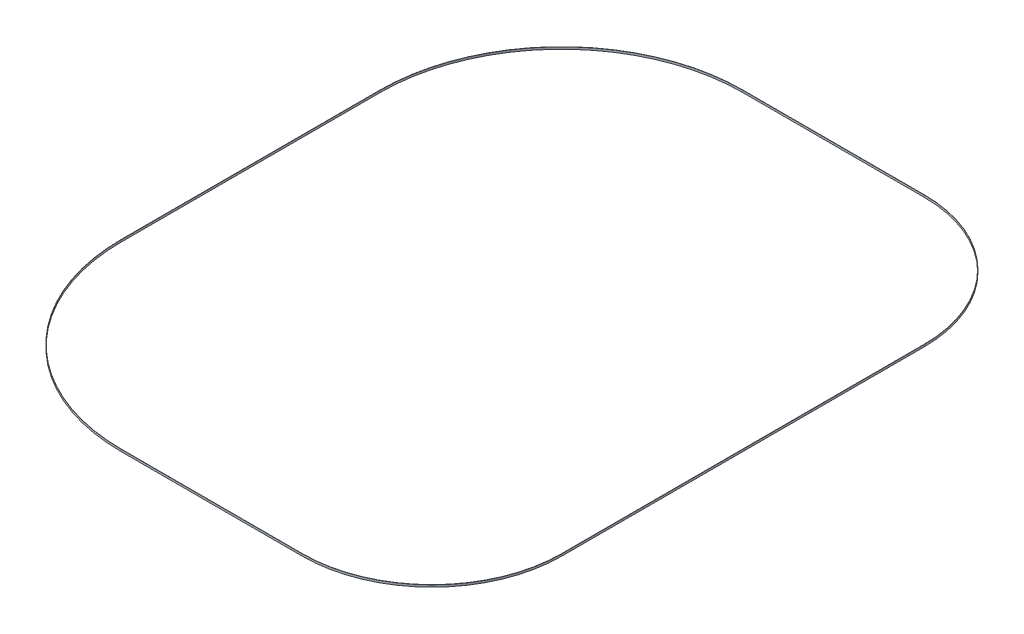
ISO-10303-21;
HEADER;
FILE_DESCRIPTION(('STEP AP214'),'2;1');
FILE_NAME('part.step','',(''),(''),'','','');
FILE_SCHEMA(('AUTOMOTIVE_DESIGN { 1 0 10303 214 1 1 1 1 }'));
ENDSEC;
DATA;
#1=APPLICATION_CONTEXT('core data for automotive mechanical design processes');
#2=APPLICATION_PROTOCOL_DEFINITION('international standard','automotive_design',2000,#1);
#3=PRODUCT_CONTEXT('',#1,'mechanical');
#4=PRODUCT('Part','Part','',(#3));
#5=PRODUCT_RELATED_PRODUCT_CATEGORY('part','',(#4));
#6=PRODUCT_DEFINITION_FORMATION('','',#4);
#7=PRODUCT_DEFINITION_CONTEXT('part definition',#1,'design');
#8=PRODUCT_DEFINITION('design','',#6,#7);
#9=PRODUCT_DEFINITION_SHAPE('','',#8);
#10=(LENGTH_UNIT() NAMED_UNIT(*) SI_UNIT(.MILLI.,.METRE.));
#11=(NAMED_UNIT(*) PLANE_ANGLE_UNIT() SI_UNIT($,.RADIAN.));
#12=(NAMED_UNIT(*) SI_UNIT($,.STERADIAN.) SOLID_ANGLE_UNIT());
#13=UNCERTAINTY_MEASURE_WITH_UNIT(LENGTH_MEASURE(1.E-05),#10,'distance_accuracy_value','');
#14=(GEOMETRIC_REPRESENTATION_CONTEXT(3) GLOBAL_UNCERTAINTY_ASSIGNED_CONTEXT((#13)) GLOBAL_UNIT_ASSIGNED_CONTEXT((#10,
#11,#12)) REPRESENTATION_CONTEXT('',''));
#15=CARTESIAN_POINT('',(0.,0.,0.));
#16=DIRECTION('',(0.,0.,1.));
#17=DIRECTION('',(1.,0.,0.));
#18=AXIS2_PLACEMENT_3D('',#15,#16,#17);
#19=CARTESIAN_POINT('',(3000.,305.,-7000.));
#20=DIRECTION('',(0.,-1.,0.));
#21=DIRECTION('',(0.,0.,-1.));
#22=AXIS2_PLACEMENT_3D('',#19,#20,#21);
#23=PLANE('',#22);
#24=CARTESIAN_POINT('',(3000.,305.,-7000.));
#25=DIRECTION('',(0.,-1.,0.));
#26=DIRECTION('',(-1.,0.,0.));
#27=AXIS2_PLACEMENT_3D('',#24,#25,#26);
#28=CIRCLE('',#27,7010.);
#29=CARTESIAN_POINT('',(3000.,305.,-14010.));
#30=VERTEX_POINT('',#29);
#31=CARTESIAN_POINT('',(-4010.,305.,-7000.));
#32=VERTEX_POINT('',#31);
#33=EDGE_CURVE('E261',#30,#32,#28,.F.);
#34=ORIENTED_EDGE('',*,*,#33,.T.);
#35=DIRECTION('',(0.,0.,1.));
#36=VECTOR('',#35,1.);
#37=CARTESIAN_POINT('',(-4010.,305.,-7000.));
#38=LINE('',#37,#36);
#39=CARTESIAN_POINT('',(-4010.,305.,3000.));
#40=VERTEX_POINT('',#39);
#41=EDGE_CURVE('E264',#32,#40,#38,.T.);
#42=ORIENTED_EDGE('',*,*,#41,.T.);
#43=CARTESIAN_POINT('',(3000.,305.,3000.));
#44=DIRECTION('',(0.,-1.,0.));
#45=DIRECTION('',(-1.,0.,0.));
#46=AXIS2_PLACEMENT_3D('',#43,#44,#45);
#47=CIRCLE('',#46,7010.);
#48=CARTESIAN_POINT('',(3000.,305.,10010.));
#49=VERTEX_POINT('',#48);
#50=EDGE_CURVE('E267',#40,#49,#47,.F.);
#51=ORIENTED_EDGE('',*,*,#50,.T.);
#52=DIRECTION('',(1.,0.,0.));
#53=VECTOR('',#52,1.);
#54=CARTESIAN_POINT('',(3000.,305.,10010.));
#55=LINE('',#54,#53);
#56=CARTESIAN_POINT('',(10000.,305.,10010.));
#57=VERTEX_POINT('',#56);
#58=EDGE_CURVE('E269',#49,#57,#55,.T.);
#59=ORIENTED_EDGE('',*,*,#58,.T.);
#60=CARTESIAN_POINT('',(10000.,305.,5000.));
#61=DIRECTION('',(0.,-1.,0.));
#62=DIRECTION('',(-1.,0.,0.));
#63=AXIS2_PLACEMENT_3D('',#60,#61,#62);
#64=CIRCLE('',#63,5010.);
#65=CARTESIAN_POINT('',(15010.,305.,5000.));
#66=VERTEX_POINT('',#65);
#67=EDGE_CURVE('E271',#57,#66,#64,.F.);
#68=ORIENTED_EDGE('',*,*,#67,.T.);
#69=DIRECTION('',(0.,0.,-1.));
#70=VECTOR('',#69,1.);
#71=CARTESIAN_POINT('',(15010.,305.,-7000.));
#72=LINE('',#71,#70);
#73=CARTESIAN_POINT('',(15010.,305.,-9000.));
#74=VERTEX_POINT('',#73);
#75=EDGE_CURVE('E273',#66,#74,#72,.T.);
#76=ORIENTED_EDGE('',*,*,#75,.T.);
#77=CARTESIAN_POINT('',(10000.,305.,-9000.));
#78=DIRECTION('',(0.,-1.,0.));
#79=DIRECTION('',(-1.,0.,0.));
#80=AXIS2_PLACEMENT_3D('',#77,#78,#79);
#81=CIRCLE('',#80,5010.);
#82=CARTESIAN_POINT('',(10000.,305.,-14010.));
#83=VERTEX_POINT('',#82);
#84=EDGE_CURVE('E275',#74,#83,#81,.F.);
#85=ORIENTED_EDGE('',*,*,#84,.T.);
#86=DIRECTION('',(-1.,0.,0.));
#87=VECTOR('',#86,1.);
#88=CARTESIAN_POINT('',(3000.,305.,-14010.));
#89=LINE('',#88,#87);
#90=EDGE_CURVE('E277',#83,#30,#89,.T.);
#91=ORIENTED_EDGE('',*,*,#90,.T.);
#92=EDGE_LOOP('',(#34,#42,#51,#59,#68,#76,#85,#91));
#93=FACE_BOUND('',#92,.T.);
#94=CARTESIAN_POINT('',(3000.,305.,-7000.));
#95=DIRECTION('',(0.,1.,0.));
#96=DIRECTION('',(0.,0.,-1.));
#97=AXIS2_PLACEMENT_3D('',#94,#95,#96);
#98=CIRCLE('',#97,7000.);
#99=CARTESIAN_POINT('',(3000.,305.,-14000.));
#100=VERTEX_POINT('',#99);
#101=CARTESIAN_POINT('',(-4000.,305.,-7000.));
#102=VERTEX_POINT('',#101);
#103=EDGE_CURVE('E196',#100,#102,#98,.T.);
#104=ORIENTED_EDGE('',*,*,#103,.F.);
#105=DIRECTION('',(-1.,0.,0.));
#106=VECTOR('',#105,1.);
#107=CARTESIAN_POINT('',(3000.,305.,-14000.));
#108=LINE('',#107,#106);
#109=CARTESIAN_POINT('',(10000.,305.,-14000.));
#110=VERTEX_POINT('',#109);
#111=EDGE_CURVE('E229',#110,#100,#108,.T.);
#112=ORIENTED_EDGE('',*,*,#111,.F.);
#113=CARTESIAN_POINT('',(10000.,305.,-9000.));
#114=DIRECTION('',(0.,1.,0.));
#115=DIRECTION('',(0.,0.,-1.));
#116=AXIS2_PLACEMENT_3D('',#113,#114,#115);
#117=CIRCLE('',#116,5000.);
#118=CARTESIAN_POINT('',(15000.,305.,-9000.));
#119=VERTEX_POINT('',#118);
#120=EDGE_CURVE('E227',#119,#110,#117,.T.);
#121=ORIENTED_EDGE('',*,*,#120,.F.);
#122=DIRECTION('',(0.,0.,-1.));
#123=VECTOR('',#122,1.);
#124=CARTESIAN_POINT('',(15000.,305.,-9000.));
#125=LINE('',#124,#123);
#126=CARTESIAN_POINT('',(15000.,305.,5000.));
#127=VERTEX_POINT('',#126);
#128=EDGE_CURVE('E225',#127,#119,#125,.T.);
#129=ORIENTED_EDGE('',*,*,#128,.F.);
#130=CARTESIAN_POINT('',(10000.,305.,5000.));
#131=DIRECTION('',(0.,1.,0.));
#132=DIRECTION('',(0.,0.,-1.));
#133=AXIS2_PLACEMENT_3D('',#130,#131,#132);
#134=CIRCLE('',#133,5000.);
#135=CARTESIAN_POINT('',(10000.,305.,10000.));
#136=VERTEX_POINT('',#135);
#137=EDGE_CURVE('E223',#136,#127,#134,.T.);
#138=ORIENTED_EDGE('',*,*,#137,.F.);
#139=DIRECTION('',(1.,0.,0.));
#140=VECTOR('',#139,1.);
#141=CARTESIAN_POINT('',(10000.,305.,10000.));
#142=LINE('',#141,#140);
#143=CARTESIAN_POINT('',(3000.,305.,10000.));
#144=VERTEX_POINT('',#143);
#145=EDGE_CURVE('E219',#144,#136,#142,.T.);
#146=ORIENTED_EDGE('',*,*,#145,.F.);
#147=CARTESIAN_POINT('',(3000.,305.,3000.));
#148=DIRECTION('',(0.,1.,0.));
#149=DIRECTION('',(0.,0.,-1.));
#150=AXIS2_PLACEMENT_3D('',#147,#148,#149);
#151=CIRCLE('',#150,7000.);
#152=CARTESIAN_POINT('',(-4000.,305.,3000.));
#153=VERTEX_POINT('',#152);
#154=EDGE_CURVE('E217',#153,#144,#151,.T.);
#155=ORIENTED_EDGE('',*,*,#154,.F.);
#156=DIRECTION('',(0.,0.,1.));
#157=VECTOR('',#156,1.);
#158=CARTESIAN_POINT('',(-4000.,305.,3000.));
#159=LINE('',#158,#157);
#160=EDGE_CURVE('E204',#102,#153,#159,.T.);
#161=ORIENTED_EDGE('',*,*,#160,.F.);
#162=EDGE_LOOP('',(#104,#112,#121,#129,#138,#146,#155,#161));
#163=FACE_BOUND('',#162,.T.);
#164=ADVANCED_FACE('F83',(#93,#163),#23,.F.);
#165=CARTESIAN_POINT('',(3000.,225.,-7000.));
#166=DIRECTION('',(0.,-1.,0.));
#167=DIRECTION('',(0.,0.,-1.));
#168=AXIS2_PLACEMENT_3D('',#165,#166,#167);
#169=PLANE('',#168);
#170=CARTESIAN_POINT('',(3000.,225.,-7000.));
#171=DIRECTION('',(0.,-1.,0.));
#172=DIRECTION('',(-1.,0.,0.));
#173=AXIS2_PLACEMENT_3D('',#170,#171,#172);
#174=CIRCLE('',#173,7010.);
#175=CARTESIAN_POINT('',(3000.,225.,-14010.));
#176=VERTEX_POINT('',#175);
#177=CARTESIAN_POINT('',(-4010.,225.,-7000.));
#178=VERTEX_POINT('',#177);
#179=EDGE_CURVE('E212',#176,#178,#174,.F.);
#180=ORIENTED_EDGE('',*,*,#179,.F.);
#181=DIRECTION('',(-1.,0.,0.));
#182=VECTOR('',#181,1.);
#183=CARTESIAN_POINT('',(3000.,225.,-14010.));
#184=LINE('',#183,#182);
#185=CARTESIAN_POINT('',(10000.,225.,-14010.));
#186=VERTEX_POINT('',#185);
#187=EDGE_CURVE('E265',#186,#176,#184,.T.);
#188=ORIENTED_EDGE('',*,*,#187,.F.);
#189=CARTESIAN_POINT('',(10000.,225.,-9000.));
#190=DIRECTION('',(0.,-1.,0.));
#191=DIRECTION('',(-1.,0.,0.));
#192=AXIS2_PLACEMENT_3D('',#189,#190,#191);
#193=CIRCLE('',#192,5010.);
#194=CARTESIAN_POINT('',(15010.,225.,-9000.));
#195=VERTEX_POINT('',#194);
#196=EDGE_CURVE('E292',#195,#186,#193,.F.);
#197=ORIENTED_EDGE('',*,*,#196,.F.);
#198=DIRECTION('',(0.,0.,-1.));
#199=VECTOR('',#198,1.);
#200=CARTESIAN_POINT('',(15010.,225.,-7000.));
#201=LINE('',#200,#199);
#202=CARTESIAN_POINT('',(15010.,225.,5000.));
#203=VERTEX_POINT('',#202);
#204=EDGE_CURVE('E290',#203,#195,#201,.T.);
#205=ORIENTED_EDGE('',*,*,#204,.F.);
#206=CARTESIAN_POINT('',(10000.,225.,5000.));
#207=DIRECTION('',(0.,-1.,0.));
#208=DIRECTION('',(-1.,0.,0.));
#209=AXIS2_PLACEMENT_3D('',#206,#207,#208);
#210=CIRCLE('',#209,5010.);
#211=CARTESIAN_POINT('',(10000.,225.,10010.));
#212=VERTEX_POINT('',#211);
#213=EDGE_CURVE('E288',#212,#203,#210,.F.);
#214=ORIENTED_EDGE('',*,*,#213,.F.);
#215=DIRECTION('',(1.,0.,0.));
#216=VECTOR('',#215,1.);
#217=CARTESIAN_POINT('',(3000.,225.,10010.));
#218=LINE('',#217,#216);
#219=CARTESIAN_POINT('',(3000.,225.,10010.));
#220=VERTEX_POINT('',#219);
#221=EDGE_CURVE('E286',#220,#212,#218,.T.);
#222=ORIENTED_EDGE('',*,*,#221,.F.);
#223=CARTESIAN_POINT('',(3000.,225.,3000.));
#224=DIRECTION('',(0.,-1.,0.));
#225=DIRECTION('',(-1.,0.,0.));
#226=AXIS2_PLACEMENT_3D('',#223,#224,#225);
#227=CIRCLE('',#226,7010.);
#228=CARTESIAN_POINT('',(-4010.,225.,3000.));
#229=VERTEX_POINT('',#228);
#230=EDGE_CURVE('E284',#229,#220,#227,.F.);
#231=ORIENTED_EDGE('',*,*,#230,.F.);
#232=DIRECTION('',(0.,0.,1.));
#233=VECTOR('',#232,1.);
#234=CARTESIAN_POINT('',(-4010.,225.,-7000.));
#235=LINE('',#234,#233);
#236=EDGE_CURVE('E282',#178,#229,#235,.T.);
#237=ORIENTED_EDGE('',*,*,#236,.F.);
#238=EDGE_LOOP('',(#180,#188,#197,#205,#214,#222,#231,#237));
#239=FACE_BOUND('',#238,.T.);
#240=DIRECTION('',(-1.,0.,0.));
#241=VECTOR('',#240,1.);
#242=CARTESIAN_POINT('',(3000.,225.,-14000.));
#243=LINE('',#242,#241);
#244=CARTESIAN_POINT('',(10000.,225.,-14000.));
#245=VERTEX_POINT('',#244);
#246=CARTESIAN_POINT('',(3000.,225.,-14000.));
#247=VERTEX_POINT('',#246);
#248=EDGE_CURVE('E205',#245,#247,#243,.T.);
#249=ORIENTED_EDGE('',*,*,#248,.T.);
#250=CARTESIAN_POINT('',(3000.,225.,-7000.));
#251=DIRECTION('',(0.,1.,0.));
#252=DIRECTION('',(0.,0.,-1.));
#253=AXIS2_PLACEMENT_3D('',#250,#251,#252);
#254=CIRCLE('',#253,7000.);
#255=CARTESIAN_POINT('',(-4000.,225.,-7000.));
#256=VERTEX_POINT('',#255);
#257=EDGE_CURVE('E106',#247,#256,#254,.T.);
#258=ORIENTED_EDGE('',*,*,#257,.T.);
#259=DIRECTION('',(0.,0.,1.));
#260=VECTOR('',#259,1.);
#261=CARTESIAN_POINT('',(-4000.,225.,3000.));
#262=LINE('',#261,#260);
#263=CARTESIAN_POINT('',(-4000.,225.,3000.));
#264=VERTEX_POINT('',#263);
#265=EDGE_CURVE('E211',#256,#264,#262,.T.);
#266=ORIENTED_EDGE('',*,*,#265,.T.);
#267=CARTESIAN_POINT('',(3000.,225.,3000.));
#268=DIRECTION('',(0.,1.,0.));
#269=DIRECTION('',(0.,0.,-1.));
#270=AXIS2_PLACEMENT_3D('',#267,#268,#269);
#271=CIRCLE('',#270,7000.);
#272=CARTESIAN_POINT('',(3000.,225.,10000.));
#273=VERTEX_POINT('',#272);
#274=EDGE_CURVE('E233',#264,#273,#271,.T.);
#275=ORIENTED_EDGE('',*,*,#274,.T.);
#276=DIRECTION('',(1.,0.,0.));
#277=VECTOR('',#276,1.);
#278=CARTESIAN_POINT('',(10000.,225.,10000.));
#279=LINE('',#278,#277);
#280=CARTESIAN_POINT('',(10000.,225.,10000.));
#281=VERTEX_POINT('',#280);
#282=EDGE_CURVE('E236',#273,#281,#279,.T.);
#283=ORIENTED_EDGE('',*,*,#282,.T.);
#284=CARTESIAN_POINT('',(10000.,225.,5000.));
#285=DIRECTION('',(0.,1.,0.));
#286=DIRECTION('',(0.,0.,-1.));
#287=AXIS2_PLACEMENT_3D('',#284,#285,#286);
#288=CIRCLE('',#287,5000.);
#289=CARTESIAN_POINT('',(15000.,225.,5000.));
#290=VERTEX_POINT('',#289);
#291=EDGE_CURVE('E239',#281,#290,#288,.T.);
#292=ORIENTED_EDGE('',*,*,#291,.T.);
#293=DIRECTION('',(0.,0.,-1.));
#294=VECTOR('',#293,1.);
#295=CARTESIAN_POINT('',(15000.,225.,-9000.));
#296=LINE('',#295,#294);
#297=CARTESIAN_POINT('',(15000.,225.,-9000.));
#298=VERTEX_POINT('',#297);
#299=EDGE_CURVE('E242',#290,#298,#296,.T.);
#300=ORIENTED_EDGE('',*,*,#299,.T.);
#301=CARTESIAN_POINT('',(10000.,225.,-9000.));
#302=DIRECTION('',(0.,1.,0.));
#303=DIRECTION('',(0.,0.,-1.));
#304=AXIS2_PLACEMENT_3D('',#301,#302,#303);
#305=CIRCLE('',#304,5000.);
#306=EDGE_CURVE('E245',#298,#245,#305,.T.);
#307=ORIENTED_EDGE('',*,*,#306,.T.);
#308=EDGE_LOOP('',(#249,#258,#266,#275,#283,#292,#300,#307));
#309=FACE_BOUND('',#308,.T.);
#310=ADVANCED_FACE('F322',(#239,#309),#169,.T.);
#311=CARTESIAN_POINT('',(3000.,305.,-7000.));
#312=DIRECTION('',(0.,-1.,0.));
#313=DIRECTION('',(0.,0.,-1.));
#314=AXIS2_PLACEMENT_3D('',#311,#312,#313);
#315=CYLINDRICAL_SURFACE('',#314,7010.);
#316=ORIENTED_EDGE('',*,*,#179,.T.);
#317=DIRECTION('',(0.,-1.,0.));
#318=VECTOR('',#317,1.);
#319=CARTESIAN_POINT('',(-4010.,305.,-7000.));
#320=LINE('',#319,#318);
#321=EDGE_CURVE('E12',#32,#178,#320,.T.);
#322=ORIENTED_EDGE('',*,*,#321,.F.);
#323=ORIENTED_EDGE('',*,*,#33,.F.);
#324=DIRECTION('',(0.,-1.,0.));
#325=VECTOR('',#324,1.);
#326=CARTESIAN_POINT('',(3000.,305.,-14010.));
#327=LINE('',#326,#325);
#328=EDGE_CURVE('E279',#30,#176,#327,.T.);
#329=ORIENTED_EDGE('',*,*,#328,.T.);
#330=EDGE_LOOP('',(#316,#322,#323,#329));
#331=FACE_BOUND('',#330,.T.);
#332=ADVANCED_FACE('F85',(#331),#315,.T.);
#333=CARTESIAN_POINT('',(-4010.,305.,-7000.));
#334=DIRECTION('',(1.,0.,0.));
#335=DIRECTION('',(0.,0.,-1.));
#336=AXIS2_PLACEMENT_3D('',#333,#334,#335);
#337=PLANE('',#336);
#338=ORIENTED_EDGE('',*,*,#236,.T.);
#339=DIRECTION('',(0.,-1.,0.));
#340=VECTOR('',#339,1.);
#341=CARTESIAN_POINT('',(-4010.,305.,3000.));
#342=LINE('',#341,#340);
#343=EDGE_CURVE('E91',#40,#229,#342,.T.);
#344=ORIENTED_EDGE('',*,*,#343,.F.);
#345=ORIENTED_EDGE('',*,*,#41,.F.);
#346=ORIENTED_EDGE('',*,*,#321,.T.);
#347=EDGE_LOOP('',(#338,#344,#345,#346));
#348=FACE_BOUND('',#347,.T.);
#349=ADVANCED_FACE('F339',(#348),#337,.F.);
#350=CARTESIAN_POINT('',(3000.,305.,3000.));
#351=DIRECTION('',(0.,-1.,0.));
#352=DIRECTION('',(0.,0.,-1.));
#353=AXIS2_PLACEMENT_3D('',#350,#351,#352);
#354=CYLINDRICAL_SURFACE('',#353,7010.);
#355=ORIENTED_EDGE('',*,*,#230,.T.);
#356=DIRECTION('',(0.,-1.,0.));
#357=VECTOR('',#356,1.);
#358=CARTESIAN_POINT('',(3000.,305.,10010.));
#359=LINE('',#358,#357);
#360=EDGE_CURVE('E309',#49,#220,#359,.T.);
#361=ORIENTED_EDGE('',*,*,#360,.F.);
#362=ORIENTED_EDGE('',*,*,#50,.F.);
#363=ORIENTED_EDGE('',*,*,#343,.T.);
#364=EDGE_LOOP('',(#355,#361,#362,#363));
#365=FACE_BOUND('',#364,.T.);
#366=ADVANCED_FACE('F316',(#365),#354,.T.);
#367=CARTESIAN_POINT('',(3000.,305.,10010.));
#368=DIRECTION('',(0.,0.,-1.));
#369=DIRECTION('',(-1.,0.,0.));
#370=AXIS2_PLACEMENT_3D('',#367,#368,#369);
#371=PLANE('',#370);
#372=ORIENTED_EDGE('',*,*,#221,.T.);
#373=DIRECTION('',(0.,-1.,0.));
#374=VECTOR('',#373,1.);
#375=CARTESIAN_POINT('',(10000.,305.,10010.));
#376=LINE('',#375,#374);
#377=EDGE_CURVE('E306',#57,#212,#376,.T.);
#378=ORIENTED_EDGE('',*,*,#377,.F.);
#379=ORIENTED_EDGE('',*,*,#58,.F.);
#380=ORIENTED_EDGE('',*,*,#360,.T.);
#381=EDGE_LOOP('',(#372,#378,#379,#380));
#382=FACE_BOUND('',#381,.T.);
#383=ADVANCED_FACE('F328',(#382),#371,.F.);
#384=CARTESIAN_POINT('',(10000.,305.,5000.));
#385=DIRECTION('',(0.,-1.,0.));
#386=DIRECTION('',(0.,0.,-1.));
#387=AXIS2_PLACEMENT_3D('',#384,#385,#386);
#388=CYLINDRICAL_SURFACE('',#387,5010.);
#389=ORIENTED_EDGE('',*,*,#213,.T.);
#390=DIRECTION('',(0.,-1.,0.));
#391=VECTOR('',#390,1.);
#392=CARTESIAN_POINT('',(15010.,305.,5000.));
#393=LINE('',#392,#391);
#394=EDGE_CURVE('E303',#66,#203,#393,.T.);
#395=ORIENTED_EDGE('',*,*,#394,.F.);
#396=ORIENTED_EDGE('',*,*,#67,.F.);
#397=ORIENTED_EDGE('',*,*,#377,.T.);
#398=EDGE_LOOP('',(#389,#395,#396,#397));
#399=FACE_BOUND('',#398,.T.);
#400=ADVANCED_FACE('F332',(#399),#388,.T.);
#401=CARTESIAN_POINT('',(15010.,305.,-7000.));
#402=DIRECTION('',(-1.,0.,0.));
#403=DIRECTION('',(0.,0.,1.));
#404=AXIS2_PLACEMENT_3D('',#401,#402,#403);
#405=PLANE('',#404);
#406=ORIENTED_EDGE('',*,*,#204,.T.);
#407=DIRECTION('',(0.,-1.,0.));
#408=VECTOR('',#407,1.);
#409=CARTESIAN_POINT('',(15010.,305.,-9000.));
#410=LINE('',#409,#408);
#411=EDGE_CURVE('E300',#74,#195,#410,.T.);
#412=ORIENTED_EDGE('',*,*,#411,.F.);
#413=ORIENTED_EDGE('',*,*,#75,.F.);
#414=ORIENTED_EDGE('',*,*,#394,.T.);
#415=EDGE_LOOP('',(#406,#412,#413,#414));
#416=FACE_BOUND('',#415,.T.);
#417=ADVANCED_FACE('F352',(#416),#405,.F.);
#418=CARTESIAN_POINT('',(10000.,305.,-9000.));
#419=DIRECTION('',(0.,-1.,0.));
#420=DIRECTION('',(0.,0.,-1.));
#421=AXIS2_PLACEMENT_3D('',#418,#419,#420);
#422=CYLINDRICAL_SURFACE('',#421,5010.);
#423=ORIENTED_EDGE('',*,*,#196,.T.);
#424=DIRECTION('',(0.,-1.,0.));
#425=VECTOR('',#424,1.);
#426=CARTESIAN_POINT('',(10000.,305.,-14010.));
#427=LINE('',#426,#425);
#428=EDGE_CURVE('E297',#83,#186,#427,.T.);
#429=ORIENTED_EDGE('',*,*,#428,.F.);
#430=ORIENTED_EDGE('',*,*,#84,.F.);
#431=ORIENTED_EDGE('',*,*,#411,.T.);
#432=EDGE_LOOP('',(#423,#429,#430,#431));
#433=FACE_BOUND('',#432,.T.);
#434=ADVANCED_FACE('F350',(#433),#422,.T.);
#435=CARTESIAN_POINT('',(3000.,305.,-14010.));
#436=DIRECTION('',(0.,0.,1.));
#437=DIRECTION('',(1.,0.,0.));
#438=AXIS2_PLACEMENT_3D('',#435,#436,#437);
#439=PLANE('',#438);
#440=ORIENTED_EDGE('',*,*,#187,.T.);
#441=ORIENTED_EDGE('',*,*,#328,.F.);
#442=ORIENTED_EDGE('',*,*,#90,.F.);
#443=ORIENTED_EDGE('',*,*,#428,.T.);
#444=EDGE_LOOP('',(#440,#441,#442,#443));
#445=FACE_BOUND('',#444,.T.);
#446=ADVANCED_FACE('F345',(#445),#439,.F.);
#447=CARTESIAN_POINT('',(3000.,305.,-7000.));
#448=DIRECTION('',(0.,-1.,0.));
#449=DIRECTION('',(0.,0.,-1.));
#450=AXIS2_PLACEMENT_3D('',#447,#448,#449);
#451=CYLINDRICAL_SURFACE('',#450,7000.);
#452=ORIENTED_EDGE('',*,*,#257,.F.);
#453=DIRECTION('',(0.,-1.,0.));
#454=VECTOR('',#453,1.);
#455=CARTESIAN_POINT('',(3000.,305.,-14000.));
#456=LINE('',#455,#454);
#457=EDGE_CURVE('E200',#100,#247,#456,.T.);
#458=ORIENTED_EDGE('',*,*,#457,.F.);
#459=ORIENTED_EDGE('',*,*,#103,.T.);
#460=DIRECTION('',(0.,-1.,0.));
#461=VECTOR('',#460,1.);
#462=CARTESIAN_POINT('',(-4000.,305.,-7000.));
#463=LINE('',#462,#461);
#464=EDGE_CURVE('E199',#102,#256,#463,.T.);
#465=ORIENTED_EDGE('',*,*,#464,.T.);
#466=EDGE_LOOP('',(#452,#458,#459,#465));
#467=FACE_BOUND('',#466,.T.);
#468=ADVANCED_FACE('F198',(#467),#451,.F.);
#469=CARTESIAN_POINT('',(-4000.,305.,3000.));
#470=DIRECTION('',(1.,0.,0.));
#471=DIRECTION('',(0.,0.,-1.));
#472=AXIS2_PLACEMENT_3D('',#469,#470,#471);
#473=PLANE('',#472);
#474=ORIENTED_EDGE('',*,*,#265,.F.);
#475=ORIENTED_EDGE('',*,*,#464,.F.);
#476=ORIENTED_EDGE('',*,*,#160,.T.);
#477=DIRECTION('',(0.,-1.,0.));
#478=VECTOR('',#477,1.);
#479=CARTESIAN_POINT('',(-4000.,305.,3000.));
#480=LINE('',#479,#478);
#481=EDGE_CURVE('E213',#153,#264,#480,.T.);
#482=ORIENTED_EDGE('',*,*,#481,.T.);
#483=EDGE_LOOP('',(#474,#475,#476,#482));
#484=FACE_BOUND('',#483,.T.);
#485=ADVANCED_FACE('F208',(#484),#473,.T.);
#486=CARTESIAN_POINT('',(3000.,305.,3000.));
#487=DIRECTION('',(0.,-1.,0.));
#488=DIRECTION('',(0.,0.,-1.));
#489=AXIS2_PLACEMENT_3D('',#486,#487,#488);
#490=CYLINDRICAL_SURFACE('',#489,7000.);
#491=ORIENTED_EDGE('',*,*,#274,.F.);
#492=ORIENTED_EDGE('',*,*,#481,.F.);
#493=ORIENTED_EDGE('',*,*,#154,.T.);
#494=DIRECTION('',(0.,-1.,0.));
#495=VECTOR('',#494,1.);
#496=CARTESIAN_POINT('',(3000.,305.,10000.));
#497=LINE('',#496,#495);
#498=EDGE_CURVE('E258',#144,#273,#497,.T.);
#499=ORIENTED_EDGE('',*,*,#498,.T.);
#500=EDGE_LOOP('',(#491,#492,#493,#499));
#501=FACE_BOUND('',#500,.T.);
#502=ADVANCED_FACE('F377',(#501),#490,.F.);
#503=CARTESIAN_POINT('',(10000.,305.,10000.));
#504=DIRECTION('',(0.,0.,-1.));
#505=DIRECTION('',(-1.,0.,0.));
#506=AXIS2_PLACEMENT_3D('',#503,#504,#505);
#507=PLANE('',#506);
#508=ORIENTED_EDGE('',*,*,#282,.F.);
#509=ORIENTED_EDGE('',*,*,#498,.F.);
#510=ORIENTED_EDGE('',*,*,#145,.T.);
#511=DIRECTION('',(0.,-1.,0.));
#512=VECTOR('',#511,1.);
#513=CARTESIAN_POINT('',(10000.,305.,10000.));
#514=LINE('',#513,#512);
#515=EDGE_CURVE('E256',#136,#281,#514,.T.);
#516=ORIENTED_EDGE('',*,*,#515,.T.);
#517=EDGE_LOOP('',(#508,#509,#510,#516));
#518=FACE_BOUND('',#517,.T.);
#519=ADVANCED_FACE('F381',(#518),#507,.T.);
#520=CARTESIAN_POINT('',(10000.,305.,5000.));
#521=DIRECTION('',(0.,-1.,0.));
#522=DIRECTION('',(0.,0.,-1.));
#523=AXIS2_PLACEMENT_3D('',#520,#521,#522);
#524=CYLINDRICAL_SURFACE('',#523,5000.);
#525=ORIENTED_EDGE('',*,*,#291,.F.);
#526=ORIENTED_EDGE('',*,*,#515,.F.);
#527=ORIENTED_EDGE('',*,*,#137,.T.);
#528=DIRECTION('',(0.,-1.,0.));
#529=VECTOR('',#528,1.);
#530=CARTESIAN_POINT('',(15000.,305.,5000.));
#531=LINE('',#530,#529);
#532=EDGE_CURVE('E254',#127,#290,#531,.T.);
#533=ORIENTED_EDGE('',*,*,#532,.T.);
#534=EDGE_LOOP('',(#525,#526,#527,#533));
#535=FACE_BOUND('',#534,.T.);
#536=ADVANCED_FACE('F387',(#535),#524,.F.);
#537=CARTESIAN_POINT('',(15000.,305.,-9000.));
#538=DIRECTION('',(-1.,0.,0.));
#539=DIRECTION('',(0.,0.,1.));
#540=AXIS2_PLACEMENT_3D('',#537,#538,#539);
#541=PLANE('',#540);
#542=ORIENTED_EDGE('',*,*,#299,.F.);
#543=ORIENTED_EDGE('',*,*,#532,.F.);
#544=ORIENTED_EDGE('',*,*,#128,.T.);
#545=DIRECTION('',(0.,-1.,0.));
#546=VECTOR('',#545,1.);
#547=CARTESIAN_POINT('',(15000.,305.,-9000.));
#548=LINE('',#547,#546);
#549=EDGE_CURVE('E252',#119,#298,#548,.T.);
#550=ORIENTED_EDGE('',*,*,#549,.T.);
#551=EDGE_LOOP('',(#542,#543,#544,#550));
#552=FACE_BOUND('',#551,.T.);
#553=ADVANCED_FACE('F391',(#552),#541,.T.);
#554=CARTESIAN_POINT('',(10000.,305.,-9000.));
#555=DIRECTION('',(0.,-1.,0.));
#556=DIRECTION('',(0.,0.,-1.));
#557=AXIS2_PLACEMENT_3D('',#554,#555,#556);
#558=CYLINDRICAL_SURFACE('',#557,5000.);
#559=ORIENTED_EDGE('',*,*,#306,.F.);
#560=ORIENTED_EDGE('',*,*,#549,.F.);
#561=ORIENTED_EDGE('',*,*,#120,.T.);
#562=DIRECTION('',(0.,-1.,0.));
#563=VECTOR('',#562,1.);
#564=CARTESIAN_POINT('',(10000.,305.,-14000.));
#565=LINE('',#564,#563);
#566=EDGE_CURVE('E98',#110,#245,#565,.T.);
#567=ORIENTED_EDGE('',*,*,#566,.T.);
#568=EDGE_LOOP('',(#559,#560,#561,#567));
#569=FACE_BOUND('',#568,.T.);
#570=ADVANCED_FACE('F395',(#569),#558,.F.);
#571=CARTESIAN_POINT('',(3000.,305.,-14000.));
#572=DIRECTION('',(0.,0.,1.));
#573=DIRECTION('',(1.,0.,0.));
#574=AXIS2_PLACEMENT_3D('',#571,#572,#573);
#575=PLANE('',#574);
#576=ORIENTED_EDGE('',*,*,#248,.F.);
#577=ORIENTED_EDGE('',*,*,#566,.F.);
#578=ORIENTED_EDGE('',*,*,#111,.T.);
#579=ORIENTED_EDGE('',*,*,#457,.T.);
#580=EDGE_LOOP('',(#576,#577,#578,#579));
#581=FACE_BOUND('',#580,.T.);
#582=ADVANCED_FACE('F399',(#581),#575,.T.);
#583=CLOSED_SHELL('',(#164,#310,#332,#349,#366,#383,#400,#417,#434,#446,#468,#485,#502,#519,
#536,#553,#570,#582));
#584=MANIFOLD_SOLID_BREP('B2',#583);
#585=ADVANCED_BREP_SHAPE_REPRESENTATION('',(#18,#584),#14);
#586=SHAPE_DEFINITION_REPRESENTATION(#9,#585);
ENDSEC;
END-ISO-10303-21;
